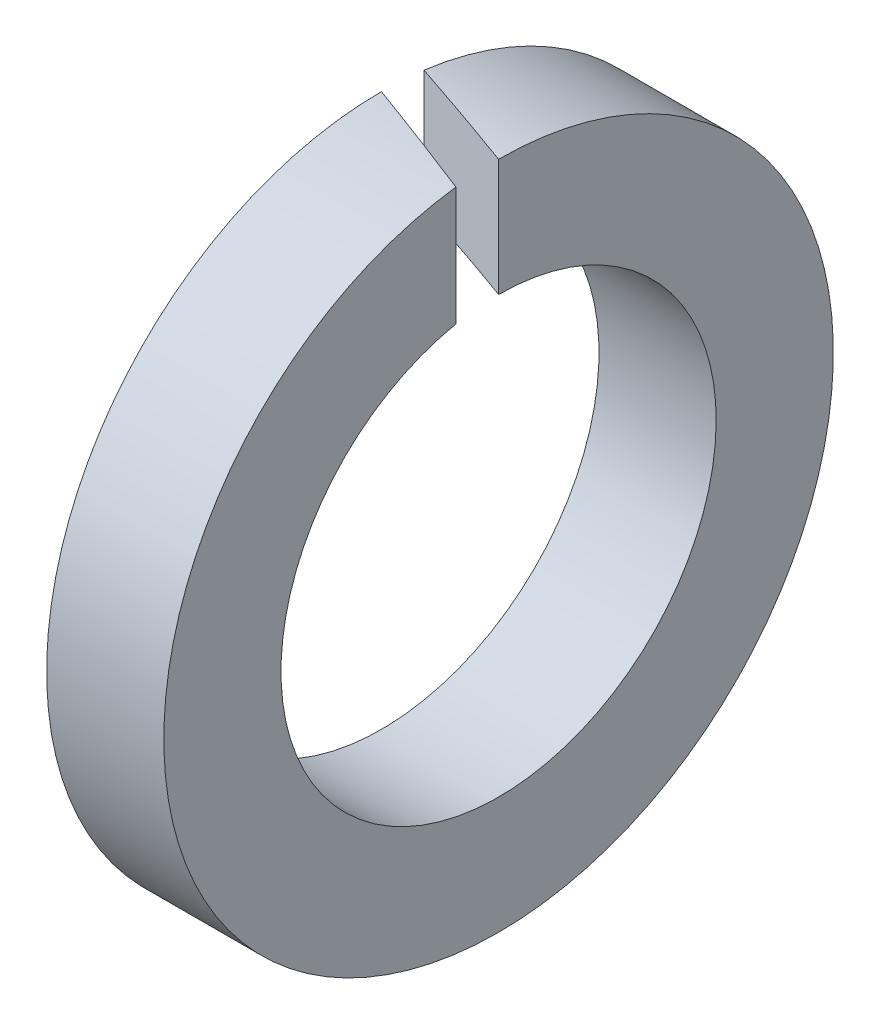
ISO-10303-21;
HEADER;
FILE_DESCRIPTION(('STEP AP214'),'2;1');
FILE_NAME('part.step','',(''),(''),'','','');
FILE_SCHEMA(('AUTOMOTIVE_DESIGN { 1 0 10303 214 1 1 1 1 }'));
ENDSEC;
DATA;
#1=APPLICATION_CONTEXT('core data for automotive mechanical design processes');
#2=APPLICATION_PROTOCOL_DEFINITION('international standard','automotive_design',2000,#1);
#3=PRODUCT_CONTEXT('',#1,'mechanical');
#4=PRODUCT('Part','Part','',(#3));
#5=PRODUCT_RELATED_PRODUCT_CATEGORY('part','',(#4));
#6=PRODUCT_DEFINITION_FORMATION('','',#4);
#7=PRODUCT_DEFINITION_CONTEXT('part definition',#1,'design');
#8=PRODUCT_DEFINITION('design','',#6,#7);
#9=PRODUCT_DEFINITION_SHAPE('','',#8);
#10=(LENGTH_UNIT() NAMED_UNIT(*) SI_UNIT(.MILLI.,.METRE.));
#11=(NAMED_UNIT(*) PLANE_ANGLE_UNIT() SI_UNIT($,.RADIAN.));
#12=(NAMED_UNIT(*) SI_UNIT($,.STERADIAN.) SOLID_ANGLE_UNIT());
#13=UNCERTAINTY_MEASURE_WITH_UNIT(LENGTH_MEASURE(1.E-05),#10,'distance_accuracy_value','');
#14=(GEOMETRIC_REPRESENTATION_CONTEXT(3) GLOBAL_UNCERTAINTY_ASSIGNED_CONTEXT((#13)) GLOBAL_UNIT_ASSIGNED_CONTEXT((#10,
#11,#12)) REPRESENTATION_CONTEXT('',''));
#15=CARTESIAN_POINT('',(0.,0.,0.));
#16=DIRECTION('',(0.,0.,1.));
#17=DIRECTION('',(1.,0.,0.));
#18=AXIS2_PLACEMENT_3D('',#15,#16,#17);
#19=CARTESIAN_POINT('',(0.,0.,-10.));
#20=DIRECTION('',(-1.,0.,0.));
#21=DIRECTION('',(0.,0.,-1.));
#22=AXIS2_PLACEMENT_3D('',#19,#20,#21);
#23=PLANE('',#22);
#24=DIRECTION('',(0.,-1.,0.));
#25=VECTOR('',#24,1.);
#26=CARTESIAN_POINT('',(0.,10.,1.27389581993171));
#27=LINE('',#26,#25);
#28=CARTESIAN_POINT('',(0.,9.9185275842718,1.27389581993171));
#29=VERTEX_POINT('',#28);
#30=CARTESIAN_POINT('',(0.,6.37394614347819,1.27389581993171));
#31=VERTEX_POINT('',#30);
#32=EDGE_CURVE('E87',#29,#31,#27,.T.);
#33=ORIENTED_EDGE('',*,*,#32,.F.);
#34=CARTESIAN_POINT('',(0.,0.,0.));
#35=DIRECTION('',(-1.,0.,0.));
#36=DIRECTION('',(0.,0.,1.));
#37=AXIS2_PLACEMENT_3D('',#34,#35,#36);
#38=CIRCLE('',#37,10.);
#39=CARTESIAN_POINT('',(0.,10.,0.));
#40=VERTEX_POINT('',#39);
#41=EDGE_CURVE('E74',#40,#29,#38,.T.);
#42=ORIENTED_EDGE('',*,*,#41,.F.);
#43=DIRECTION('',(0.,-1.,0.));
#44=VECTOR('',#43,1.);
#45=CARTESIAN_POINT('',(0.,10.,0.));
#46=LINE('',#45,#44);
#47=CARTESIAN_POINT('',(0.,6.5,0.));
#48=VERTEX_POINT('',#47);
#49=EDGE_CURVE('E91',#40,#48,#46,.T.);
#50=ORIENTED_EDGE('',*,*,#49,.T.);
#51=CARTESIAN_POINT('',(0.,0.,0.));
#52=DIRECTION('',(-1.,0.,0.));
#53=DIRECTION('',(0.,0.,1.));
#54=AXIS2_PLACEMENT_3D('',#51,#52,#53);
#55=CIRCLE('',#54,6.5);
#56=EDGE_CURVE('E100',#48,#31,#55,.T.);
#57=ORIENTED_EDGE('',*,*,#56,.T.);
#58=EDGE_LOOP('',(#33,#42,#50,#57));
#59=FACE_BOUND('',#58,.T.);
#60=ADVANCED_FACE('F33',(#59),#23,.F.);
#61=CARTESIAN_POINT('',(0.,0.,0.));
#62=DIRECTION('',(1.,0.,0.));
#63=DIRECTION('',(0.,0.,1.));
#64=AXIS2_PLACEMENT_3D('',#61,#62,#63);
#65=CYLINDRICAL_SURFACE('',#64,6.5);
#66=CARTESIAN_POINT('',(-3.5,0.,0.));
#67=DIRECTION('',(-0.34202014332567,0.,0.939692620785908));
#68=DIRECTION('',(0.939692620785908,0.,0.34202014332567));
#69=AXIS2_PLACEMENT_3D('',#66,#67,#68);
#70=ELLIPSE('',#69,19.00472860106,6.5);
#71=CARTESIAN_POINT('',(-3.5,6.5,0.));
#72=VERTEX_POINT('',#71);
#73=EDGE_CURVE('E86',#72,#31,#70,.F.);
#74=ORIENTED_EDGE('',*,*,#73,.T.);
#75=ORIENTED_EDGE('',*,*,#56,.F.);
#76=CARTESIAN_POINT('',(0.,0.,0.));
#77=DIRECTION('',(0.342020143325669,0.,-0.939692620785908));
#78=DIRECTION('',(0.939692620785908,0.,0.342020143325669));
#79=AXIS2_PLACEMENT_3D('',#76,#77,#78);
#80=ELLIPSE('',#79,19.00472860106,6.5);
#81=CARTESIAN_POINT('',(-3.5,6.37394614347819,-1.27389581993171));
#82=VERTEX_POINT('',#81);
#83=EDGE_CURVE('E89',#48,#82,#80,.F.);
#84=ORIENTED_EDGE('',*,*,#83,.T.);
#85=CARTESIAN_POINT('',(-3.5,0.,0.));
#86=DIRECTION('',(-1.,0.,0.));
#87=DIRECTION('',(0.,0.,1.));
#88=AXIS2_PLACEMENT_3D('',#85,#86,#87);
#89=CIRCLE('',#88,6.5);
#90=EDGE_CURVE('E82',#82,#72,#89,.T.);
#91=ORIENTED_EDGE('',*,*,#90,.T.);
#92=EDGE_LOOP('',(#74,#75,#84,#91));
#93=FACE_BOUND('',#92,.T.);
#94=ADVANCED_FACE('F107',(#93),#65,.F.);
#95=CARTESIAN_POINT('',(-3.5,0.,-10.));
#96=DIRECTION('',(1.,0.,0.));
#97=DIRECTION('',(0.,0.,1.));
#98=AXIS2_PLACEMENT_3D('',#95,#96,#97);
#99=PLANE('',#98);
#100=DIRECTION('',(0.,-1.,0.));
#101=VECTOR('',#100,1.);
#102=CARTESIAN_POINT('',(-3.5,10.,0.));
#103=LINE('',#102,#101);
#104=CARTESIAN_POINT('',(-3.5,10.,0.));
#105=VERTEX_POINT('',#104);
#106=EDGE_CURVE('E79',#105,#72,#103,.T.);
#107=ORIENTED_EDGE('',*,*,#106,.T.);
#108=ORIENTED_EDGE('',*,*,#90,.F.);
#109=DIRECTION('',(0.,-1.,0.));
#110=VECTOR('',#109,1.);
#111=CARTESIAN_POINT('',(-3.5,10.,-1.27389581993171));
#112=LINE('',#111,#110);
#113=CARTESIAN_POINT('',(-3.5,9.9185275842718,-1.27389581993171));
#114=VERTEX_POINT('',#113);
#115=EDGE_CURVE('E81',#114,#82,#112,.T.);
#116=ORIENTED_EDGE('',*,*,#115,.F.);
#117=CARTESIAN_POINT('',(-3.5,0.,0.));
#118=DIRECTION('',(-1.,0.,0.));
#119=DIRECTION('',(0.,0.,1.));
#120=AXIS2_PLACEMENT_3D('',#117,#118,#119);
#121=CIRCLE('',#120,10.);
#122=EDGE_CURVE('E71',#114,#105,#121,.T.);
#123=ORIENTED_EDGE('',*,*,#122,.T.);
#124=EDGE_LOOP('',(#107,#108,#116,#123));
#125=FACE_BOUND('',#124,.T.);
#126=ADVANCED_FACE('F77',(#125),#99,.F.);
#127=CARTESIAN_POINT('',(0.,0.,0.));
#128=DIRECTION('',(1.,0.,0.));
#129=DIRECTION('',(0.,0.,1.));
#130=AXIS2_PLACEMENT_3D('',#127,#128,#129);
#131=CYLINDRICAL_SURFACE('',#130,10.);
#132=CARTESIAN_POINT('',(-3.5,0.,0.));
#133=DIRECTION('',(-0.34202014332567,0.,0.939692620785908));
#134=DIRECTION('',(0.939692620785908,0.,0.34202014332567));
#135=AXIS2_PLACEMENT_3D('',#132,#133,#134);
#136=ELLIPSE('',#135,29.2380440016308,10.);
#137=EDGE_CURVE('E11',#29,#105,#136,.T.);
#138=ORIENTED_EDGE('',*,*,#137,.T.);
#139=ORIENTED_EDGE('',*,*,#122,.F.);
#140=CARTESIAN_POINT('',(0.,0.,0.));
#141=DIRECTION('',(0.342020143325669,0.,-0.939692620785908));
#142=DIRECTION('',(0.939692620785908,0.,0.342020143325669));
#143=AXIS2_PLACEMENT_3D('',#140,#141,#142);
#144=ELLIPSE('',#143,29.2380440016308,10.);
#145=EDGE_CURVE('E40',#114,#40,#144,.T.);
#146=ORIENTED_EDGE('',*,*,#145,.T.);
#147=ORIENTED_EDGE('',*,*,#41,.T.);
#148=EDGE_LOOP('',(#138,#139,#146,#147));
#149=FACE_BOUND('',#148,.T.);
#150=ADVANCED_FACE('F70',(#149),#131,.T.);
#151=CARTESIAN_POINT('',(0.,10.,0.));
#152=DIRECTION('',(-0.342020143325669,0.,0.939692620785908));
#153=DIRECTION('',(-0.939692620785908,0.,-0.342020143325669));
#154=AXIS2_PLACEMENT_3D('',#151,#152,#153);
#155=PLANE('',#154);
#156=ORIENTED_EDGE('',*,*,#83,.F.);
#157=ORIENTED_EDGE('',*,*,#49,.F.);
#158=ORIENTED_EDGE('',*,*,#145,.F.);
#159=ORIENTED_EDGE('',*,*,#115,.T.);
#160=EDGE_LOOP('',(#156,#157,#158,#159));
#161=FACE_BOUND('',#160,.T.);
#162=ADVANCED_FACE('F103',(#161),#155,.T.);
#163=CARTESIAN_POINT('',(-3.5,10.,0.));
#164=DIRECTION('',(0.34202014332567,0.,-0.939692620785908));
#165=DIRECTION('',(0.939692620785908,0.,0.34202014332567));
#166=AXIS2_PLACEMENT_3D('',#163,#164,#165);
#167=PLANE('',#166);
#168=ORIENTED_EDGE('',*,*,#73,.F.);
#169=ORIENTED_EDGE('',*,*,#106,.F.);
#170=ORIENTED_EDGE('',*,*,#137,.F.);
#171=ORIENTED_EDGE('',*,*,#32,.T.);
#172=EDGE_LOOP('',(#168,#169,#170,#171));
#173=FACE_BOUND('',#172,.T.);
#174=ADVANCED_FACE('F85',(#173),#167,.T.);
#175=CLOSED_SHELL('',(#60,#94,#126,#150,#162,#174));
#176=MANIFOLD_SOLID_BREP('B2',#175);
#177=ADVANCED_BREP_SHAPE_REPRESENTATION('',(#18,#176),#14);
#178=SHAPE_DEFINITION_REPRESENTATION(#9,#177);
ENDSEC;
END-ISO-10303-21;
